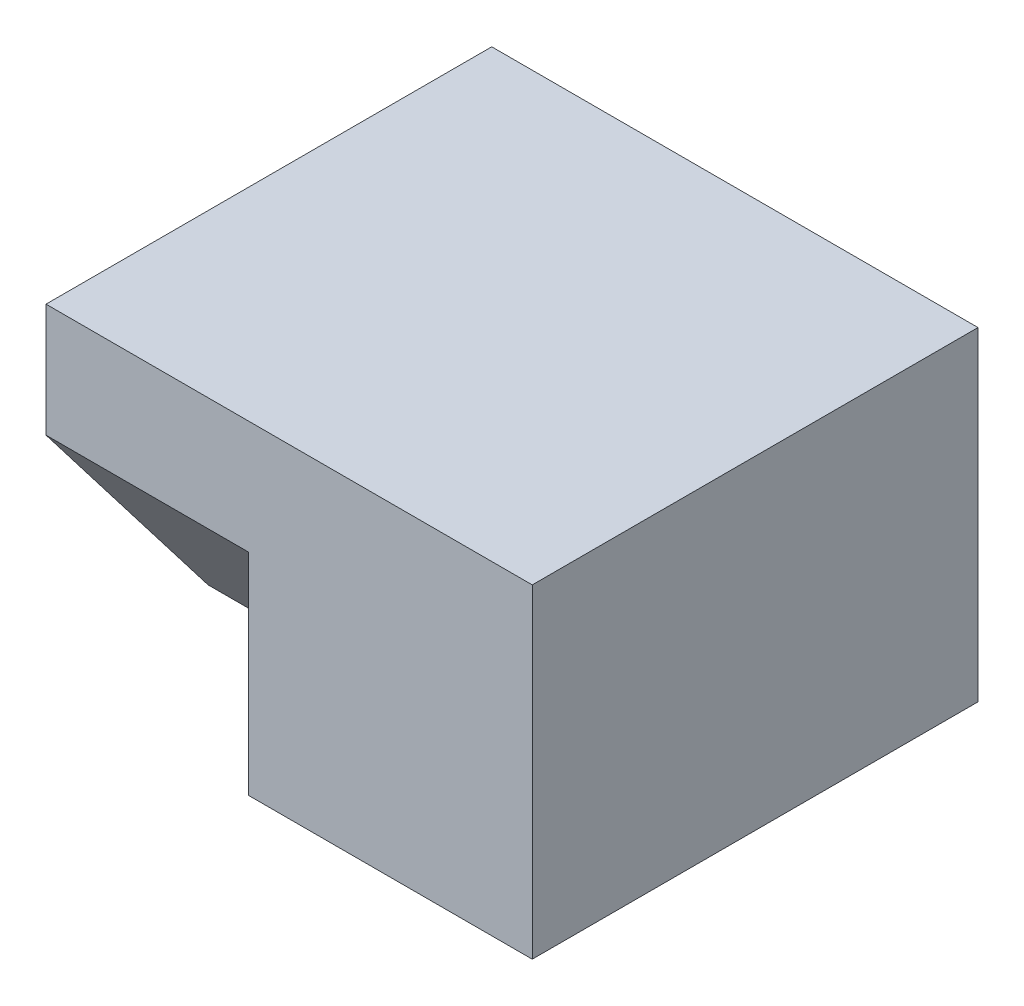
ISO-10303-21;
HEADER;
FILE_DESCRIPTION(('STEP AP214'),'2;1');
FILE_NAME('part.step','',(''),(''),'','','');
FILE_SCHEMA(('AUTOMOTIVE_DESIGN { 1 0 10303 214 1 1 1 1 }'));
ENDSEC;
DATA;
#1=APPLICATION_CONTEXT('core data for automotive mechanical design processes');
#2=APPLICATION_PROTOCOL_DEFINITION('international standard','automotive_design',2000,#1);
#3=PRODUCT_CONTEXT('',#1,'mechanical');
#4=PRODUCT('Part','Part','',(#3));
#5=PRODUCT_RELATED_PRODUCT_CATEGORY('part','',(#4));
#6=PRODUCT_DEFINITION_FORMATION('','',#4);
#7=PRODUCT_DEFINITION_CONTEXT('part definition',#1,'design');
#8=PRODUCT_DEFINITION('design','',#6,#7);
#9=PRODUCT_DEFINITION_SHAPE('','',#8);
#10=(LENGTH_UNIT() NAMED_UNIT(*) SI_UNIT(.MILLI.,.METRE.));
#11=(NAMED_UNIT(*) PLANE_ANGLE_UNIT() SI_UNIT($,.RADIAN.));
#12=(NAMED_UNIT(*) SI_UNIT($,.STERADIAN.) SOLID_ANGLE_UNIT());
#13=UNCERTAINTY_MEASURE_WITH_UNIT(LENGTH_MEASURE(1.E-05),#10,'distance_accuracy_value','');
#14=(GEOMETRIC_REPRESENTATION_CONTEXT(3) GLOBAL_UNCERTAINTY_ASSIGNED_CONTEXT((#13)) GLOBAL_UNIT_ASSIGNED_CONTEXT((#10,
#11,#12)) REPRESENTATION_CONTEXT('',''));
#15=CARTESIAN_POINT('',(0.,0.,0.));
#16=DIRECTION('',(0.,0.,1.));
#17=DIRECTION('',(1.,0.,0.));
#18=AXIS2_PLACEMENT_3D('',#15,#16,#17);
#19=CARTESIAN_POINT('',(0.,0.,55.));
#20=DIRECTION('',(-1.,0.,0.));
#21=DIRECTION('',(0.,0.,1.));
#22=AXIS2_PLACEMENT_3D('',#19,#20,#21);
#23=PLANE('',#22);
#24=DIRECTION('',(0.,1.,0.));
#25=VECTOR('',#24,1.);
#26=CARTESIAN_POINT('',(0.,0.,0.));
#27=LINE('',#26,#25);
#28=CARTESIAN_POINT('',(0.,0.,0.));
#29=VERTEX_POINT('',#28);
#30=CARTESIAN_POINT('',(0.,40.,0.));
#31=VERTEX_POINT('',#30);
#32=EDGE_CURVE('E108',#29,#31,#27,.T.);
#33=ORIENTED_EDGE('',*,*,#32,.T.);
#34=DIRECTION('',(0.,0.,-1.));
#35=VECTOR('',#34,1.);
#36=CARTESIAN_POINT('',(0.,40.,55.));
#37=LINE('',#36,#35);
#38=CARTESIAN_POINT('',(0.,40.,55.));
#39=VERTEX_POINT('',#38);
#40=EDGE_CURVE('E11',#39,#31,#37,.T.);
#41=ORIENTED_EDGE('',*,*,#40,.F.);
#42=DIRECTION('',(0.,1.,0.));
#43=VECTOR('',#42,1.);
#44=CARTESIAN_POINT('',(0.,0.,55.));
#45=LINE('',#44,#43);
#46=CARTESIAN_POINT('',(0.,0.,55.));
#47=VERTEX_POINT('',#46);
#48=EDGE_CURVE('E110',#47,#39,#45,.T.);
#49=ORIENTED_EDGE('',*,*,#48,.F.);
#50=DIRECTION('',(0.,0.,-1.));
#51=VECTOR('',#50,1.);
#52=CARTESIAN_POINT('',(0.,0.,55.));
#53=LINE('',#52,#51);
#54=EDGE_CURVE('E117',#47,#29,#53,.T.);
#55=ORIENTED_EDGE('',*,*,#54,.T.);
#56=EDGE_LOOP('',(#33,#41,#49,#55));
#57=FACE_BOUND('',#56,.T.);
#58=ADVANCED_FACE('F30',(#57),#23,.F.);
#59=CARTESIAN_POINT('',(0.,40.,55.));
#60=DIRECTION('',(0.,-1.,0.));
#61=DIRECTION('',(1.,0.,0.));
#62=AXIS2_PLACEMENT_3D('',#59,#60,#61);
#63=PLANE('',#62);
#64=DIRECTION('',(-1.,0.,0.));
#65=VECTOR('',#64,1.);
#66=CARTESIAN_POINT('',(0.,40.,0.));
#67=LINE('',#66,#65);
#68=CARTESIAN_POINT('',(-60.,40.,0.));
#69=VERTEX_POINT('',#68);
#70=EDGE_CURVE('E120',#31,#69,#67,.T.);
#71=ORIENTED_EDGE('',*,*,#70,.T.);
#72=DIRECTION('',(0.,0.,-1.));
#73=VECTOR('',#72,1.);
#74=CARTESIAN_POINT('',(-60.,40.,55.));
#75=LINE('',#74,#73);
#76=CARTESIAN_POINT('',(-60.,40.,55.));
#77=VERTEX_POINT('',#76);
#78=EDGE_CURVE('E37',#77,#69,#75,.T.);
#79=ORIENTED_EDGE('',*,*,#78,.F.);
#80=DIRECTION('',(-1.,0.,0.));
#81=VECTOR('',#80,1.);
#82=CARTESIAN_POINT('',(0.,40.,55.));
#83=LINE('',#82,#81);
#84=EDGE_CURVE('E77',#39,#77,#83,.T.);
#85=ORIENTED_EDGE('',*,*,#84,.F.);
#86=ORIENTED_EDGE('',*,*,#40,.T.);
#87=EDGE_LOOP('',(#71,#79,#85,#86));
#88=FACE_BOUND('',#87,.T.);
#89=ADVANCED_FACE('F150',(#88),#63,.F.);
#90=CARTESIAN_POINT('',(-60.,0.,55.));
#91=DIRECTION('',(1.,0.,0.));
#92=DIRECTION('',(0.,0.,-1.));
#93=AXIS2_PLACEMENT_3D('',#90,#91,#92);
#94=PLANE('',#93);
#95=DIRECTION('',(0.,0.,-1.));
#96=VECTOR('',#95,1.);
#97=CARTESIAN_POINT('',(-60.,0.,55.));
#98=LINE('',#97,#96);
#99=CARTESIAN_POINT('',(-60.,0.,35.));
#100=VERTEX_POINT('',#99);
#101=CARTESIAN_POINT('',(-60.,0.,0.));
#102=VERTEX_POINT('',#101);
#103=EDGE_CURVE('E127',#100,#102,#98,.T.);
#104=ORIENTED_EDGE('',*,*,#103,.F.);
#105=DIRECTION('',(0.,-0.7926239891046,-0.609710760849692));
#106=VECTOR('',#105,1.);
#107=CARTESIAN_POINT('',(-60.,0.,35.));
#108=LINE('',#107,#106);
#109=CARTESIAN_POINT('',(-60.,26.,55.));
#110=VERTEX_POINT('',#109);
#111=EDGE_CURVE('E95',#110,#100,#108,.T.);
#112=ORIENTED_EDGE('',*,*,#111,.F.);
#113=DIRECTION('',(0.,-1.,0.));
#114=VECTOR('',#113,1.);
#115=CARTESIAN_POINT('',(-60.,0.,55.));
#116=LINE('',#115,#114);
#117=EDGE_CURVE('E113',#77,#110,#116,.T.);
#118=ORIENTED_EDGE('',*,*,#117,.F.);
#119=ORIENTED_EDGE('',*,*,#78,.T.);
#120=DIRECTION('',(0.,-1.,0.));
#121=VECTOR('',#120,1.);
#122=CARTESIAN_POINT('',(-60.,0.,0.));
#123=LINE('',#122,#121);
#124=EDGE_CURVE('E122',#69,#102,#123,.T.);
#125=ORIENTED_EDGE('',*,*,#124,.T.);
#126=EDGE_LOOP('',(#104,#112,#118,#119,#125));
#127=FACE_BOUND('',#126,.T.);
#128=ADVANCED_FACE('F132',(#127),#94,.F.);
#129=CARTESIAN_POINT('',(0.,0.,55.));
#130=DIRECTION('',(0.,1.,0.));
#131=DIRECTION('',(-1.,0.,0.));
#132=AXIS2_PLACEMENT_3D('',#129,#130,#131);
#133=PLANE('',#132);
#134=DIRECTION('',(0.,0.,1.));
#135=VECTOR('',#134,1.);
#136=CARTESIAN_POINT('',(-35.,0.,55.));
#137=LINE('',#136,#135);
#138=CARTESIAN_POINT('',(-35.,0.,35.));
#139=VERTEX_POINT('',#138);
#140=CARTESIAN_POINT('',(-35.,0.,55.));
#141=VERTEX_POINT('',#140);
#142=EDGE_CURVE('E44',#139,#141,#137,.T.);
#143=ORIENTED_EDGE('',*,*,#142,.F.);
#144=DIRECTION('',(-1.,0.,0.));
#145=VECTOR('',#144,1.);
#146=CARTESIAN_POINT('',(-35.,0.,35.));
#147=LINE('',#146,#145);
#148=EDGE_CURVE('E91',#139,#100,#147,.T.);
#149=ORIENTED_EDGE('',*,*,#148,.T.);
#150=ORIENTED_EDGE('',*,*,#103,.T.);
#151=DIRECTION('',(1.,0.,0.));
#152=VECTOR('',#151,1.);
#153=CARTESIAN_POINT('',(0.,0.,0.));
#154=LINE('',#153,#152);
#155=EDGE_CURVE('E72',#102,#29,#154,.T.);
#156=ORIENTED_EDGE('',*,*,#155,.T.);
#157=ORIENTED_EDGE('',*,*,#54,.F.);
#158=DIRECTION('',(1.,0.,0.));
#159=VECTOR('',#158,1.);
#160=CARTESIAN_POINT('',(0.,0.,55.));
#161=LINE('',#160,#159);
#162=EDGE_CURVE('E52',#141,#47,#161,.T.);
#163=ORIENTED_EDGE('',*,*,#162,.F.);
#164=EDGE_LOOP('',(#143,#149,#150,#156,#157,#163));
#165=FACE_BOUND('',#164,.T.);
#166=ADVANCED_FACE('F103',(#165),#133,.F.);
#167=CARTESIAN_POINT('',(0.,40.,55.));
#168=DIRECTION('',(0.,0.,1.));
#169=DIRECTION('',(1.,0.,0.));
#170=AXIS2_PLACEMENT_3D('',#167,#168,#169);
#171=PLANE('',#170);
#172=DIRECTION('',(-1.,0.,0.));
#173=VECTOR('',#172,1.);
#174=CARTESIAN_POINT('',(-35.,26.,55.));
#175=LINE('',#174,#173);
#176=CARTESIAN_POINT('',(-35.,26.,55.));
#177=VERTEX_POINT('',#176);
#178=EDGE_CURVE('E97',#177,#110,#175,.T.);
#179=ORIENTED_EDGE('',*,*,#178,.F.);
#180=DIRECTION('',(0.,1.,0.));
#181=VECTOR('',#180,1.);
#182=CARTESIAN_POINT('',(-35.,26.,55.));
#183=LINE('',#182,#181);
#184=EDGE_CURVE('E98',#141,#177,#183,.T.);
#185=ORIENTED_EDGE('',*,*,#184,.F.);
#186=ORIENTED_EDGE('',*,*,#162,.T.);
#187=ORIENTED_EDGE('',*,*,#48,.T.);
#188=ORIENTED_EDGE('',*,*,#84,.T.);
#189=ORIENTED_EDGE('',*,*,#117,.T.);
#190=EDGE_LOOP('',(#179,#185,#186,#187,#188,#189));
#191=FACE_BOUND('',#190,.T.);
#192=ADVANCED_FACE('F139',(#191),#171,.T.);
#193=CARTESIAN_POINT('',(0.,40.,0.));
#194=DIRECTION('',(0.,0.,1.));
#195=DIRECTION('',(1.,0.,0.));
#196=AXIS2_PLACEMENT_3D('',#193,#194,#195);
#197=PLANE('',#196);
#198=ORIENTED_EDGE('',*,*,#32,.F.);
#199=ORIENTED_EDGE('',*,*,#155,.F.);
#200=ORIENTED_EDGE('',*,*,#124,.F.);
#201=ORIENTED_EDGE('',*,*,#70,.F.);
#202=EDGE_LOOP('',(#198,#199,#200,#201));
#203=FACE_BOUND('',#202,.T.);
#204=ADVANCED_FACE('F135',(#203),#197,.F.);
#205=CARTESIAN_POINT('',(-35.,0.,35.));
#206=DIRECTION('',(0.,0.609710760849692,-0.7926239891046));
#207=DIRECTION('',(0.,0.7926239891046,0.609710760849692));
#208=AXIS2_PLACEMENT_3D('',#205,#206,#207);
#209=PLANE('',#208);
#210=ORIENTED_EDGE('',*,*,#111,.T.);
#211=ORIENTED_EDGE('',*,*,#148,.F.);
#212=DIRECTION('',(0.,-0.7926239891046,-0.609710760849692));
#213=VECTOR('',#212,1.);
#214=CARTESIAN_POINT('',(-35.,0.,35.));
#215=LINE('',#214,#213);
#216=EDGE_CURVE('E93',#177,#139,#215,.T.);
#217=ORIENTED_EDGE('',*,*,#216,.F.);
#218=ORIENTED_EDGE('',*,*,#178,.T.);
#219=EDGE_LOOP('',(#210,#211,#217,#218));
#220=FACE_BOUND('',#219,.T.);
#221=ADVANCED_FACE('F92',(#220),#209,.F.);
#222=CARTESIAN_POINT('',(-35.,0.,35.));
#223=DIRECTION('',(-1.,0.,0.));
#224=DIRECTION('',(0.,0.,1.));
#225=AXIS2_PLACEMENT_3D('',#222,#223,#224);
#226=PLANE('',#225);
#227=ORIENTED_EDGE('',*,*,#216,.T.);
#228=ORIENTED_EDGE('',*,*,#142,.T.);
#229=ORIENTED_EDGE('',*,*,#184,.T.);
#230=EDGE_LOOP('',(#227,#228,#229));
#231=FACE_BOUND('',#230,.T.);
#232=ADVANCED_FACE('F100',(#231),#226,.T.);
#233=CLOSED_SHELL('',(#58,#89,#128,#166,#192,#204,#221,#232));
#234=MANIFOLD_SOLID_BREP('B2',#233);
#235=ADVANCED_BREP_SHAPE_REPRESENTATION('',(#18,#234),#14);
#236=SHAPE_DEFINITION_REPRESENTATION(#9,#235);
ENDSEC;
END-ISO-10303-21;
